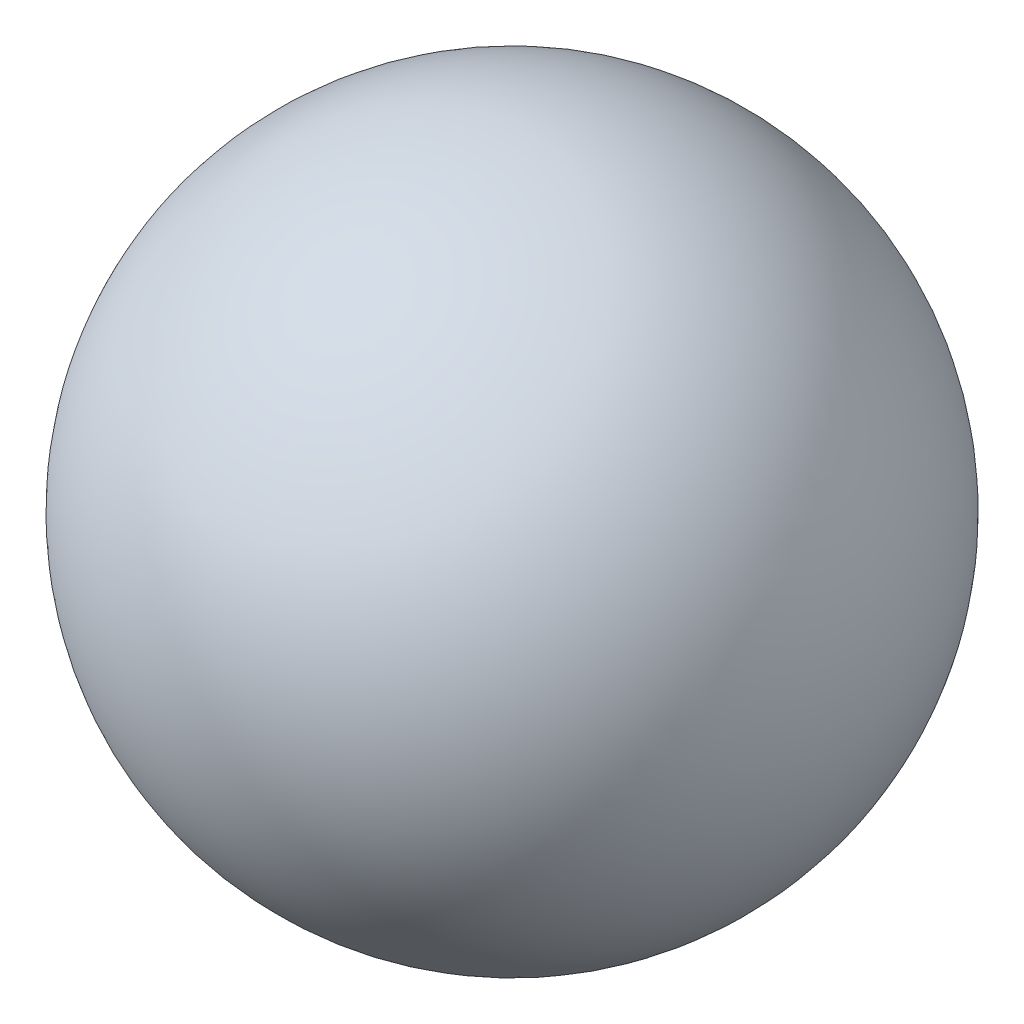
ISO-10303-21;
HEADER;
FILE_DESCRIPTION(('STEP AP214'),'2;1');
FILE_NAME('part.step','',(''),(''),'','','');
FILE_SCHEMA(('AUTOMOTIVE_DESIGN { 1 0 10303 214 1 1 1 1 }'));
ENDSEC;
DATA;
#1=APPLICATION_CONTEXT('core data for automotive mechanical design processes');
#2=APPLICATION_PROTOCOL_DEFINITION('international standard','automotive_design',2000,#1);
#3=PRODUCT_CONTEXT('',#1,'mechanical');
#4=PRODUCT('Part','Part','',(#3));
#5=PRODUCT_RELATED_PRODUCT_CATEGORY('part','',(#4));
#6=PRODUCT_DEFINITION_FORMATION('','',#4);
#7=PRODUCT_DEFINITION_CONTEXT('part definition',#1,'design');
#8=PRODUCT_DEFINITION('design','',#6,#7);
#9=PRODUCT_DEFINITION_SHAPE('','',#8);
#10=(LENGTH_UNIT() NAMED_UNIT(*) SI_UNIT(.MILLI.,.METRE.));
#11=(NAMED_UNIT(*) PLANE_ANGLE_UNIT() SI_UNIT($,.RADIAN.));
#12=(NAMED_UNIT(*) SI_UNIT($,.STERADIAN.) SOLID_ANGLE_UNIT());
#13=UNCERTAINTY_MEASURE_WITH_UNIT(LENGTH_MEASURE(1.E-05),#10,'distance_accuracy_value','');
#14=(GEOMETRIC_REPRESENTATION_CONTEXT(3) GLOBAL_UNCERTAINTY_ASSIGNED_CONTEXT((#13)) GLOBAL_UNIT_ASSIGNED_CONTEXT((#10,
#11,#12)) REPRESENTATION_CONTEXT('',''));
#15=CARTESIAN_POINT('',(0.,0.,0.));
#16=DIRECTION('',(0.,0.,1.));
#17=DIRECTION('',(1.,0.,0.));
#18=AXIS2_PLACEMENT_3D('',#15,#16,#17);
#19=CARTESIAN_POINT('',(4.,10.,0.));
#20=DIRECTION('',(1.,0.,0.));
#21=DIRECTION('',(0.,-1.,0.));
#22=AXIS2_PLACEMENT_3D('',#19,#20,#21);
#23=SPHERICAL_SURFACE('',#22,2.4);
#24=CARTESIAN_POINT('',(6.4,10.,0.));
#25=VERTEX_POINT('',#24);
#26=VERTEX_LOOP('',#25);
#27=FACE_BOUND('',#26,.T.);
#28=ADVANCED_FACE('F27',(#27),#23,.T.);
#29=CLOSED_SHELL('',(#28));
#30=MANIFOLD_SOLID_BREP('B2',#29);
#31=ADVANCED_BREP_SHAPE_REPRESENTATION('',(#18,#30),#14);
#32=SHAPE_DEFINITION_REPRESENTATION(#9,#31);
ENDSEC;
END-ISO-10303-21;
